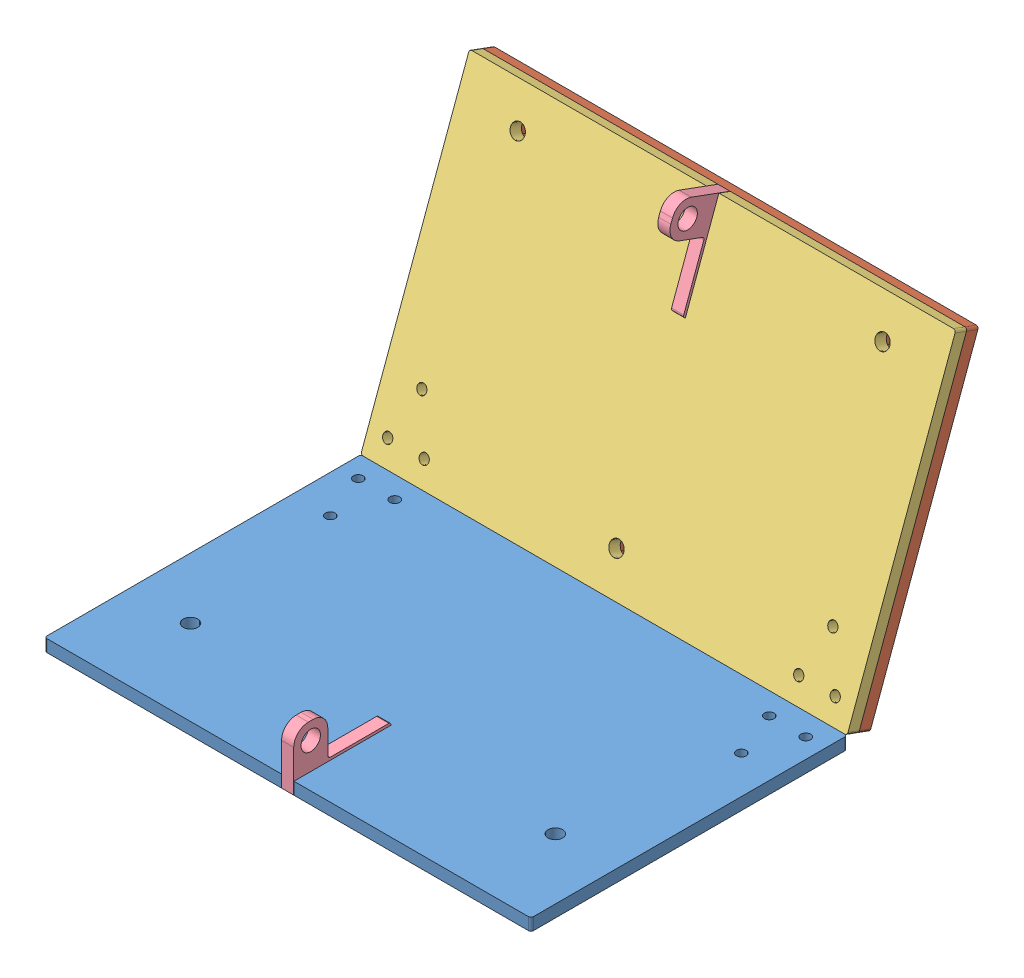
SolidWorks assembly Assem1.SLDASM, configuration Default (file format 7000). Lengths in mm.
Overall size (200 133.26 184.1).
5 component instances, 4 part files, 11 mates.
Components (placement in the parent):
- basisplaat-1: basisplaat.SLDPRT [Default] at (-35.5267 101.8736 93.8879) size (200 5 130)
- voorplaat-1: voorplaat.SLDPRT [Default] at (-35.5267 105.1538 89.1929) x (1 0 0) z (0 0.938985 -0.343957) size (200 5 130)
- top plaat-1: top plaat.SLDPRT [Default] at (-35.5267 106.8736 93.8879) x (1 0 0) z (0 0.938985 -0.343957) size (200 5 130)
- oogjes-1: oogjes.SLDPRT [Default] at (66.9233 227.2219 44.4785) x (-1 0 0) z (0 0.938985 -0.343957) size (5 23 40)
- oogjes-2: oogjes.SLDPRT [Default] at (61.9233 101.8736 223.8879) size (5 23 40)
Mates (geometry in assembly coordinates):
- Coincident1: coincident aligned: line of basisplaat-1 through (163.4733 106.8736 93.8879) axis (-1 0 0); line of top plaat-1 through (163.4733 106.8736 93.8879) axis (-1 0 0)
- Coincident2: coincident aligned: plane of basisplaat-1 through (-35.5267 106.8736 93.8879) normal (-1 0 0); plane of top plaat-1 through (-35.5267 105.1538 89.1929) normal (-1 0 0)
- Coincident3: coincident aligned: line of voorplaat-1 through (163.4733 105.1538 89.1929) axis (-1 0 0); line of top plaat-1 through (163.4733 105.1538 89.1929) axis (-1 0 0)
- Coincident4: coincident anti-aligned: plane of voorplaat-1 through (-35.5267 105.1538 89.1929) normal (0 0.343957 0.938985); plane of top plaat-1 through (-35.5267 105.1538 89.1929) normal (0 -0.343957 -0.938985)
- Coincident5: coincident aligned: plane of voorplaat-1 through (-35.5267 103.434 84.498) normal (-1 0 0); plane of top plaat-1 through (-35.5267 105.1538 89.1929) normal (-1 0 0)
- Coincident6: coincident anti-aligned: plane of basisplaat-1 through (61.9233 106.8736 223.8879) normal (1 0 0); plane of oogjes-2 through (61.9233 118.8736 217.8879) normal (-1 0 0)
- Coincident7: coincident anti-aligned: plane of basisplaat-1 through (67.0233 106.8736 183.8879) normal (0 0 1); plane of oogjes-2 through (66.9233 101.8736 183.8879) normal (0 0 -1)
- Coincident8: coincident aligned: plane of basisplaat-1 through (-35.5267 101.8736 93.8879) normal (0 -1 0); plane of oogjes-2 through (66.9233 101.8736 223.8879) normal (0 -1 0)
- Coincident13: coincident anti-aligned: plane of voorplaat-1 through (-35.5267 105.1538 89.1929) normal (0 0.343957 0.938985); plane of oogjes-1 through (61.9233 227.2219 44.4785) normal (0 -0.343957 -0.938985)
- Coincident14: coincident anti-aligned: plane of top plaat-1 through (61.9233 227.2219 44.4785) normal (1 0 0); plane of oogjes-1 through (61.9233 227.4352 62.505) normal (-1 0 0)
- Coincident15: coincident aligned: plane of top plaat-1 through (-35.5267 227.2219 44.4785) normal (0 0.938985 -0.343957); plane of oogjes-1 through (61.9233 229.2856 50.1125) normal (0 0.938985 -0.343957)
